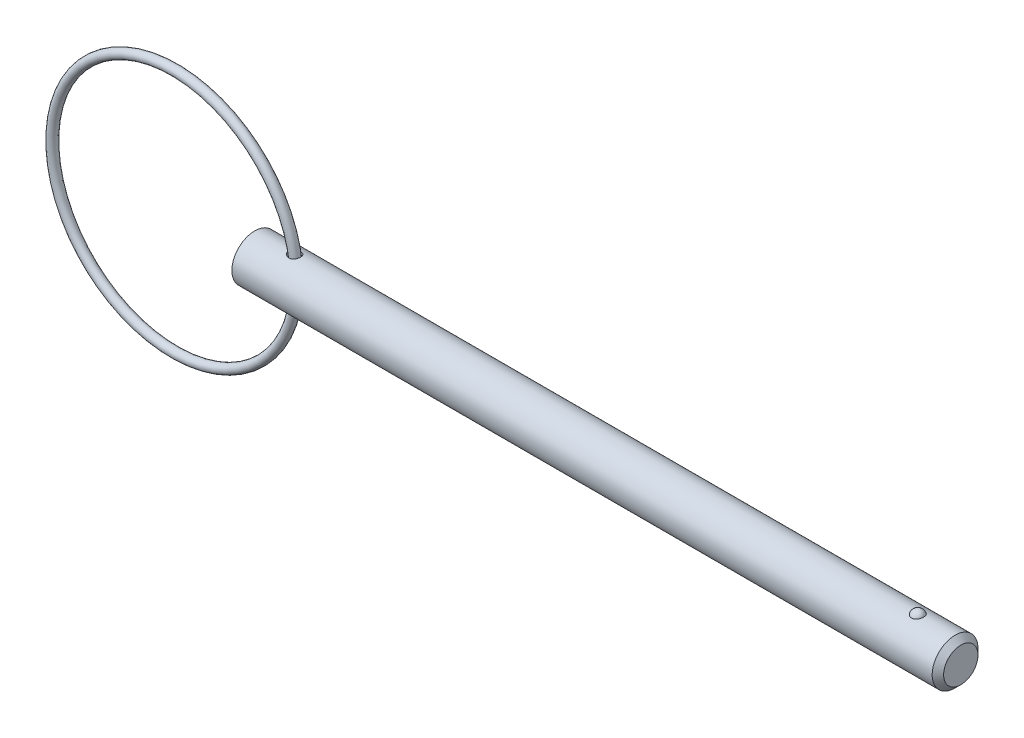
ISO-10303-21;
HEADER;
FILE_DESCRIPTION(('STEP AP214'),'2;1');
FILE_NAME('part.step','',(''),(''),'','','');
FILE_SCHEMA(('AUTOMOTIVE_DESIGN { 1 0 10303 214 1 1 1 1 }'));
ENDSEC;
DATA;
#1=APPLICATION_CONTEXT('core data for automotive mechanical design processes');
#2=APPLICATION_PROTOCOL_DEFINITION('international standard','automotive_design',2000,#1);
#3=PRODUCT_CONTEXT('',#1,'mechanical');
#4=PRODUCT('Part','Part','',(#3));
#5=PRODUCT_RELATED_PRODUCT_CATEGORY('part','',(#4));
#6=PRODUCT_DEFINITION_FORMATION('','',#4);
#7=PRODUCT_DEFINITION_CONTEXT('part definition',#1,'design');
#8=PRODUCT_DEFINITION('design','',#6,#7);
#9=PRODUCT_DEFINITION_SHAPE('','',#8);
#10=(LENGTH_UNIT() NAMED_UNIT(*) SI_UNIT(.MILLI.,.METRE.));
#11=(NAMED_UNIT(*) PLANE_ANGLE_UNIT() SI_UNIT($,.RADIAN.));
#12=(NAMED_UNIT(*) SI_UNIT($,.STERADIAN.) SOLID_ANGLE_UNIT());
#13=UNCERTAINTY_MEASURE_WITH_UNIT(LENGTH_MEASURE(1.E-05),#10,'distance_accuracy_value','');
#14=(GEOMETRIC_REPRESENTATION_CONTEXT(3) GLOBAL_UNCERTAINTY_ASSIGNED_CONTEXT((#13)) GLOBAL_UNIT_ASSIGNED_CONTEXT((#10,
#11,#12)) REPRESENTATION_CONTEXT('',''));
#15=CARTESIAN_POINT('',(0.,0.,0.));
#16=DIRECTION('',(0.,0.,1.));
#17=DIRECTION('',(1.,0.,0.));
#18=AXIS2_PLACEMENT_3D('',#15,#16,#17);
#19=CARTESIAN_POINT('',(-8.3302379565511,0.,0.));
#20=DIRECTION('',(0.,0.,1.));
#21=DIRECTION('',(1.,0.,0.));
#22=AXIS2_PLACEMENT_3D('',#19,#20,#21);
#23=TOROIDAL_SURFACE('',#22,12.7,0.476000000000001);
#24=CARTESIAN_POINT('',(4.8457620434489,0.,0.));
#25=VERTEX_POINT('',#24);
#26=VERTEX_LOOP('',#25);
#27=FACE_BOUND('',#26,.T.);
#28=ADVANCED_FACE('P0_F12',(#27),#23,.T.);
#29=CLOSED_SHELL('',(#28));
#30=MANIFOLD_SOLID_BREP('P0_B1',#29);
#31=CARTESIAN_POINT('',(0.,0.,0.));
#32=DIRECTION('',(1.,0.,0.));
#33=DIRECTION('',(0.,0.,-1.));
#34=AXIS2_PLACEMENT_3D('',#31,#32,#33);
#35=CYLINDRICAL_SURFACE('',#34,2.38);
#36=CARTESIAN_POINT('',(3.67748265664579,2.35074198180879,-0.372037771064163));
#37=CARTESIAN_POINT('',(3.70046616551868,2.34644965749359,-0.399158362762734));
#38=CARTESIAN_POINT('',(3.72581651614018,2.34199234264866,-0.424274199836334));
#39=CARTESIAN_POINT('',(3.78042747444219,2.33326580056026,-0.469907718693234));
#40=CARTESIAN_POINT('',(3.80969342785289,2.32899684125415,-0.490419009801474));
#41=CARTESIAN_POINT('',(3.87128330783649,2.32114904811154,-0.526312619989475));
#42=CARTESIAN_POINT('',(3.90360537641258,2.31756979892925,-0.541698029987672));
#43=CARTESIAN_POINT('',(3.9704452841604,2.31153734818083,-0.566889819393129));
#44=CARTESIAN_POINT('',(4.00496214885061,2.30908365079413,-0.576698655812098));
#45=CARTESIAN_POINT('',(4.07500735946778,2.30564492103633,-0.590297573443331));
#46=CARTESIAN_POINT('',(4.1105275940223,2.30465036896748,-0.594126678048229));
#47=CARTESIAN_POINT('',(4.18170718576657,2.30426876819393,-0.595606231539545));
#48=CARTESIAN_POINT('',(4.21736649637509,2.30488122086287,-0.593258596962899));
#49=CARTESIAN_POINT('',(4.28577822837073,2.30759475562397,-0.582609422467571));
#50=CARTESIAN_POINT('',(4.31858437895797,2.30961492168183,-0.574631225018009));
#51=CARTESIAN_POINT('',(4.38227060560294,2.31483318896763,-0.553233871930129));
#52=CARTESIAN_POINT('',(4.41315097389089,2.31803111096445,-0.539815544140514));
#53=CARTESIAN_POINT('',(4.47118254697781,2.3251225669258,-0.508384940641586));
#54=CARTESIAN_POINT('',(4.49841743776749,2.32899254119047,-0.490521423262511));
#55=CARTESIAN_POINT('',(4.5494826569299,2.33706025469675,-0.450515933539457));
#56=CARTESIAN_POINT('',(4.57331285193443,2.34125800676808,-0.42837379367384));
#57=CARTESIAN_POINT('',(4.6171621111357,2.34956202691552,-0.380209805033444));
#58=CARTESIAN_POINT('',(4.63714543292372,2.35366715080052,-0.354155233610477));
#59=CARTESIAN_POINT('',(4.67254725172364,2.36130301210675,-0.299034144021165));
#60=CARTESIAN_POINT('',(4.68796545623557,2.36483371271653,-0.26996743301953));
#61=CARTESIAN_POINT('',(4.71403776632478,2.37098548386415,-0.209215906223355));
#62=CARTESIAN_POINT('',(4.72462580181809,2.37359383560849,-0.177501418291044));
#63=CARTESIAN_POINT('',(4.74046966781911,2.37755210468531,-0.112692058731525));
#64=CARTESIAN_POINT('',(4.74572552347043,2.37890202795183,-0.0795971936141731));
#65=CARTESIAN_POINT('',(4.75077448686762,2.38019811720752,-0.0129544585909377));
#66=CARTESIAN_POINT('',(4.75056573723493,2.38014380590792,0.0205935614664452));
#67=CARTESIAN_POINT('',(4.74468604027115,2.37863606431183,0.0871753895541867));
#68=CARTESIAN_POINT('',(4.73901506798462,2.37718262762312,0.120209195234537));
#69=CARTESIAN_POINT('',(4.72236472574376,2.37303648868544,0.184779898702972));
#70=CARTESIAN_POINT('',(4.71139268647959,2.37034549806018,0.216318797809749));
#71=CARTESIAN_POINT('',(4.68441400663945,2.36401552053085,0.277063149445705));
#72=CARTESIAN_POINT('',(4.66840715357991,2.36037649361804,0.306268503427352));
#73=CARTESIAN_POINT('',(4.63170627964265,2.35253749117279,0.361595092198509));
#74=CARTESIAN_POINT('',(4.61100040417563,2.34833610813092,0.387708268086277));
#75=CARTESIAN_POINT('',(4.56544852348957,2.33984863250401,0.436017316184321));
#76=CARTESIAN_POINT('',(4.54060272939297,2.33556254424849,0.458213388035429));
#77=CARTESIAN_POINT('',(4.48760111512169,2.32742099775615,0.497916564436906));
#78=CARTESIAN_POINT('',(4.45946763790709,2.32356294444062,0.515452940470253));
#79=CARTESIAN_POINT('',(4.40055109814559,2.31668866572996,0.545520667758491));
#80=CARTESIAN_POINT('',(4.3697684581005,2.31367230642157,0.558052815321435));
#81=CARTESIAN_POINT('',(4.30694930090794,2.30886128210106,0.577633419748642));
#82=CARTESIAN_POINT('',(4.27493988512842,2.30704826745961,0.584764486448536));
#83=CARTESIAN_POINT('',(4.21014558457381,2.30475365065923,0.593744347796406));
#84=CARTESIAN_POINT('',(4.17736068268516,2.30427207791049,0.595593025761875));
#85=CARTESIAN_POINT('',(4.11170515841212,2.30466513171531,0.59406986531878));
#86=CARTESIAN_POINT('',(4.07883545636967,2.30554895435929,0.5906626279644));
#87=CARTESIAN_POINT('',(4.01408593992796,2.30856010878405,0.578780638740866));
#88=CARTESIAN_POINT('',(3.98220636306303,2.31068773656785,0.570304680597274));
#89=CARTESIAN_POINT('',(3.91877258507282,2.31605973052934,0.548090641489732));
#90=CARTESIAN_POINT('',(3.88730095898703,2.31935100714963,0.534128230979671));
#91=CARTESIAN_POINT('',(3.82705133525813,2.32664713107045,0.501391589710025));
#92=CARTESIAN_POINT('',(3.79827429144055,2.33065222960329,0.482615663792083));
#93=CARTESIAN_POINT('',(3.7429634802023,2.3391254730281,0.4397600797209));
#94=CARTESIAN_POINT('',(3.71658313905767,2.3436062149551,0.415484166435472));
#95=CARTESIAN_POINT('',(3.66839516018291,2.35235146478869,0.362706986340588));
#96=CARTESIAN_POINT('',(3.64658727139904,2.35661598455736,0.334205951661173));
#97=CARTESIAN_POINT('',(3.60882605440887,2.36432007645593,0.27436882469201));
#98=CARTESIAN_POINT('',(3.59274982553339,2.36777633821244,0.243112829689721));
#99=CARTESIAN_POINT('',(3.56652169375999,2.3735493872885,0.178112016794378));
#100=CARTESIAN_POINT('',(3.5563653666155,2.3758670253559,0.144369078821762));
#101=CARTESIAN_POINT('',(3.54309691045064,2.37891982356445,0.0783638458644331));
#102=CARTESIAN_POINT('',(3.53947205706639,2.37976992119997,0.0462095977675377));
#103=CARTESIAN_POINT('',(3.53785288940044,2.38014795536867,-0.0182487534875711));
#104=CARTESIAN_POINT('',(3.5398575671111,2.37967612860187,-0.0505528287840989));
#105=CARTESIAN_POINT('',(3.54913867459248,2.37752661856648,-0.112617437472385));
#106=CARTESIAN_POINT('',(3.5561353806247,2.37591295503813,-0.142422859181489));
#107=CARTESIAN_POINT('',(3.5747775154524,2.37172196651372,-0.200451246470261));
#108=CARTESIAN_POINT('',(3.58642049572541,2.36914514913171,-0.228675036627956));
#109=CARTESIAN_POINT('',(3.61071901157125,2.36396321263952,-0.276620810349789));
#110=CARTESIAN_POINT('',(3.62251818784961,2.36150235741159,-0.296799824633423));
#111=CARTESIAN_POINT('',(3.64836661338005,2.35629864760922,-0.335619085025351));
#112=CARTESIAN_POINT('',(3.66241608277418,2.353555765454,-0.354259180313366));
#113=CARTESIAN_POINT('',(3.67748265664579,2.35074198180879,-0.372037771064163));
#114=B_SPLINE_CURVE_WITH_KNOTS('',3,(#36,#37,#38,#39,#40,#41,#42,#43,#44,#45,#46,#47,#48,#49,
#50,#51,#52,#53,#54,#55,#56,#57,#58,#59,#60,#61,#62,#63,#64,#65,#66,#67,#68,#69,#70,#71,#72,#73,
#74,#75,#76,#77,#78,#79,#80,#81,#82,#83,#84,#85,#86,#87,#88,#89,#90,#91,#92,#93,#94,#95,#96,#97,
#98,#99,#100,#101,#102,#103,#104,#105,#106,#107,#108,#109,#110,#111,#112,#113),.UNSPECIFIED.,
.T.,.F.,(4,2,2,2,2,2,2,2,2,2,2,2,2,2,2,2,2,2,2,2,2,2,2,2,2,2,2,2,2,2,2,2,2,2,2,2,2,2,4),(0.,
0.107335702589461,0.214819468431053,0.322238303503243,0.429609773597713,0.536277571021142,
0.642912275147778,0.743874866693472,0.844822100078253,0.942762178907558,1.04070609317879,
1.13952022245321,1.23834068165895,1.33847507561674,1.43860899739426,1.53877695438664,
1.63894536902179,1.7389756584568,1.83901017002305,1.93929990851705,2.03958453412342,
2.13922343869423,2.23884648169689,2.33691317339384,2.43498203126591,2.53371427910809,
2.63247003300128,2.73577311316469,2.83911262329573,2.94697761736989,3.05483668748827,
3.16021984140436,3.2655241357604,3.36212700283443,3.45871257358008,3.55027266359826,
3.64178456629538,3.71214035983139,3.78250304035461),.UNSPECIFIED.);
#115=CARTESIAN_POINT('',(3.67748265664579,2.35074198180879,-0.372037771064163));
#116=VERTEX_POINT('',#115);
#117=EDGE_CURVE('P1_E40',#116,#116,#114,.T.);
#118=ORIENTED_EDGE('',*,*,#117,.T.);
#119=EDGE_LOOP('',(#118));
#120=FACE_BOUND('',#119,.T.);
#121=CARTESIAN_POINT('',(72.735,0.,0.));
#122=DIRECTION('',(1.,0.,0.));
#123=DIRECTION('',(0.,0.,-1.));
#124=AXIS2_PLACEMENT_3D('',#121,#122,#123);
#125=CIRCLE('',#124,2.38);
#126=CARTESIAN_POINT('',(72.735,0.,-2.38));
#127=VERTEX_POINT('',#126);
#128=EDGE_CURVE('P1_E25',#127,#127,#125,.T.);
#129=ORIENTED_EDGE('',*,*,#128,.F.);
#130=EDGE_LOOP('',(#129));
#131=FACE_BOUND('',#130,.T.);
#132=CARTESIAN_POINT('',(0.,0.,0.));
#133=DIRECTION('',(1.,0.,0.));
#134=DIRECTION('',(0.,0.,-1.));
#135=AXIS2_PLACEMENT_3D('',#132,#133,#134);
#136=CIRCLE('',#135,2.38);
#137=CARTESIAN_POINT('',(0.,0.,-2.38));
#138=VERTEX_POINT('',#137);
#139=EDGE_CURVE('P1_E9',#138,#138,#136,.T.);
#140=ORIENTED_EDGE('',*,*,#139,.T.);
#141=EDGE_LOOP('',(#140));
#142=FACE_BOUND('',#141,.T.);
#143=CARTESIAN_POINT('',(68.8634492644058,2.2921568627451,0.640637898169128));
#144=CARTESIAN_POINT('',(68.8303559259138,2.29215737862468,0.640637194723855));
#145=CARTESIAN_POINT('',(68.7972546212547,2.29293179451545,0.637884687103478));
#146=CARTESIAN_POINT('',(68.7320176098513,2.29594030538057,0.626968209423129));
#147=CARTESIAN_POINT('',(68.6998823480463,2.29817506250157,0.618801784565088));
#148=CARTESIAN_POINT('',(68.6375402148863,2.30384308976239,0.597351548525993));
#149=CARTESIAN_POINT('',(68.6073305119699,2.30727454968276,0.584075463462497));
#150=CARTESIAN_POINT('',(68.5495674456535,2.31495941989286,0.55282960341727));
#151=CARTESIAN_POINT('',(68.5220141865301,2.31921286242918,0.53485964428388));
#152=CARTESIAN_POINT('',(68.4695938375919,2.32820213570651,0.494282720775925));
#153=CARTESIAN_POINT('',(68.4448050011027,2.33294694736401,0.471576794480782));
#154=CARTESIAN_POINT('',(68.3992169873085,2.34234144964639,0.422446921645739));
#155=CARTESIAN_POINT('',(68.3784185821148,2.34699112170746,0.396022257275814));
#156=CARTESIAN_POINT('',(68.3403580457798,2.3559394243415,0.338855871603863));
#157=CARTESIAN_POINT('',(68.3233051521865,2.36021170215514,0.307970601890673));
#158=CARTESIAN_POINT('',(68.2943607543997,2.3677057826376,0.243750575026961));
#159=CARTESIAN_POINT('',(68.2824701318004,2.37092740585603,0.210415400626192));
#160=CARTESIAN_POINT('',(68.2638076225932,2.37606901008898,0.141189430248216));
#161=CARTESIAN_POINT('',(68.2571956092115,2.37794816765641,0.105252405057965));
#162=CARTESIAN_POINT('',(68.2498095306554,2.38005135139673,0.0327351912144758));
#163=CARTESIAN_POINT('',(68.2490358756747,2.38027526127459,-0.00384504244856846));
#164=CARTESIAN_POINT('',(68.2533628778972,2.37903842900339,-0.0769838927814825));
#165=CARTESIAN_POINT('',(68.2585202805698,2.37756141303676,-0.113538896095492));
#166=CARTESIAN_POINT('',(68.2747013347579,2.37305303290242,-0.185229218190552));
#167=CARTESIAN_POINT('',(68.2857251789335,2.37002161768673,-0.220364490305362));
#168=CARTESIAN_POINT('',(68.3133977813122,2.36273722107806,-0.288156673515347));
#169=CARTESIAN_POINT('',(68.3300389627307,2.35848588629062,-0.320816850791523));
#170=CARTESIAN_POINT('',(68.3685984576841,2.34923130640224,-0.382744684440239));
#171=CARTESIAN_POINT('',(68.390516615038,2.34422808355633,-0.412012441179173));
#172=CARTESIAN_POINT('',(68.4387549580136,2.33412555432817,-0.465830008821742));
#173=CARTESIAN_POINT('',(68.465002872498,2.32902887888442,-0.490444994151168));
#174=CARTESIAN_POINT('',(68.5214769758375,2.31926941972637,-0.5347003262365));
#175=CARTESIAN_POINT('',(68.551702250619,2.3146065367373,-0.554341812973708));
#176=CARTESIAN_POINT('',(68.6140618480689,2.30645675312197,-0.587312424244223));
#177=CARTESIAN_POINT('',(68.6460780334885,2.30293152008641,-0.600855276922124));
#178=CARTESIAN_POINT('',(68.7120795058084,2.29725171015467,-0.62222045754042));
#179=CARTESIAN_POINT('',(68.7460641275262,2.29509667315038,-0.63004470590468));
#180=CARTESIAN_POINT('',(68.813299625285,2.29249264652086,-0.639452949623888));
#181=CARTESIAN_POINT('',(68.8465087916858,2.29196755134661,-0.641315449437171));
#182=CARTESIAN_POINT('',(68.912763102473,2.29246849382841,-0.639522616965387));
#183=CARTESIAN_POINT('',(68.9458082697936,2.29349430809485,-0.635868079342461));
#184=CARTESIAN_POINT('',(69.0101025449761,2.29694059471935,-0.623301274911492));
#185=CARTESIAN_POINT('',(69.0413744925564,2.29933234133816,-0.614497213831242));
#186=CARTESIAN_POINT('',(69.1019952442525,2.30522511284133,-0.592006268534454));
#187=CARTESIAN_POINT('',(69.1313438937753,2.30872622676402,-0.578318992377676));
#188=CARTESIAN_POINT('',(69.1880369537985,2.31655795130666,-0.546112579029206));
#189=CARTESIAN_POINT('',(69.215320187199,2.32090569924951,-0.527490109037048));
#190=CARTESIAN_POINT('',(69.2664904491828,2.32992206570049,-0.48611785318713));
#191=CARTESIAN_POINT('',(69.2903767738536,2.33459075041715,-0.463367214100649));
#192=CARTESIAN_POINT('',(69.3352722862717,2.34399834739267,-0.413220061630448));
#193=CARTESIAN_POINT('',(69.3560972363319,2.34873051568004,-0.385657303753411));
#194=CARTESIAN_POINT('',(69.393056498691,2.35754932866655,-0.327455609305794));
#195=CARTESIAN_POINT('',(69.4091898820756,2.36163584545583,-0.296816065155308));
#196=CARTESIAN_POINT('',(69.4369822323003,2.36889321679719,-0.232047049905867));
#197=CARTESIAN_POINT('',(69.4484450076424,2.37202275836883,-0.197828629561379));
#198=CARTESIAN_POINT('',(69.4657523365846,2.37681926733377,-0.127900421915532));
#199=CARTESIAN_POINT('',(69.4715962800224,2.37848607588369,-0.0921904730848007));
#200=CARTESIAN_POINT('',(69.477605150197,2.38020024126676,-0.0196348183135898));
#201=CARTESIAN_POINT('',(69.4776704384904,2.38021918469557,0.0172198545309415));
#202=CARTESIAN_POINT('',(69.4718689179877,2.37856356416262,0.0904219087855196));
#203=CARTESIAN_POINT('',(69.4660018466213,2.37688892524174,0.126769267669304));
#204=CARTESIAN_POINT('',(69.448425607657,2.37201688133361,0.198028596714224));
#205=CARTESIAN_POINT('',(69.436699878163,2.36881516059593,0.232936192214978));
#206=CARTESIAN_POINT('',(69.4076354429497,2.36123444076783,0.300196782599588));
#207=CARTESIAN_POINT('',(69.3902967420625,2.3568554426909,0.332549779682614));
#208=CARTESIAN_POINT('',(69.3505350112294,2.34744667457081,0.393495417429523));
#209=CARTESIAN_POINT('',(69.3281528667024,2.34242227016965,0.422115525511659));
#210=CARTESIAN_POINT('',(69.2787391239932,2.33227293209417,0.475004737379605));
#211=CARTESIAN_POINT('',(69.2517076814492,2.32714800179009,0.499273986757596));
#212=CARTESIAN_POINT('',(69.1944988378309,2.31755359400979,0.54204602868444));
#213=CARTESIAN_POINT('',(69.1644297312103,2.31306986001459,0.560690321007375));
#214=CARTESIAN_POINT('',(69.1013869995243,2.3051412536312,0.592447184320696));
#215=CARTESIAN_POINT('',(69.0684158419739,2.30169550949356,0.605564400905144));
#216=CARTESIAN_POINT('',(69.0068424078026,2.29677744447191,0.623927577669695));
#217=CARTESIAN_POINT('',(68.9785555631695,2.29505839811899,0.63017893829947));
#218=CARTESIAN_POINT('',(68.9213308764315,2.29274795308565,0.638534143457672));
#219=CARTESIAN_POINT('',(68.8923931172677,2.29215641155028,0.64063851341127));
#220=CARTESIAN_POINT('',(68.8634492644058,2.2921568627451,0.640637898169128));
#221=B_SPLINE_CURVE_WITH_KNOTS('',3,(#143,#144,#145,#146,#147,#148,#149,#150,#151,#152,#153,
#154,#155,#156,#157,#158,#159,#160,#161,#162,#163,#164,#165,#166,#167,#168,#169,#170,#171,#172,
#173,#174,#175,#176,#177,#178,#179,#180,#181,#182,#183,#184,#185,#186,#187,#188,#189,#190,#191,
#192,#193,#194,#195,#196,#197,#198,#199,#200,#201,#202,#203,#204,#205,#206,#207,#208,#209,#210,
#211,#212,#213,#214,#215,#216,#217,#218,#219,#220),.UNSPECIFIED.,.T.,.F.,(4,2,2,2,2,2,2,2,2,2,2,
2,2,2,2,2,2,2,2,2,2,2,2,2,2,2,2,2,2,2,2,2,2,2,2,2,2,2,4),(0.,0.0991724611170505,
0.198389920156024,0.297457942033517,0.396529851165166,0.497927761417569,0.599345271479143,
0.705475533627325,0.811623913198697,0.920876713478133,1.03013718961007,1.1404517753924,
1.25076998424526,1.3609399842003,1.47110672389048,1.57959248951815,1.6880533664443,
1.79234266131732,1.89659691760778,1.99590391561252,2.0951966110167,2.19247425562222,
2.28975970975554,2.38926978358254,2.48880044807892,2.59293588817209,2.69709193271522,
2.80525821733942,2.91343624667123,3.02347917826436,3.13352698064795,3.24388765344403,
3.35424823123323,3.46374443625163,3.57323697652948,3.67968690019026,3.78604717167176,
3.87279565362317,3.9595331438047),.UNSPECIFIED.);
#222=CARTESIAN_POINT('',(68.8634492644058,2.2921568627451,0.640637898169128));
#223=VERTEX_POINT('',#222);
#224=EDGE_CURVE('P1_E34',#223,#223,#221,.T.);
#225=ORIENTED_EDGE('',*,*,#224,.T.);
#226=EDGE_LOOP('',(#225));
#227=FACE_BOUND('',#226,.T.);
#228=CARTESIAN_POINT('',(3.67748265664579,-2.35074198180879,-0.372037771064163));
#229=CARTESIAN_POINT('',(3.65652023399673,-2.35465684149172,-0.34730037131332));
#230=CARTESIAN_POINT('',(3.63751328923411,-2.35843676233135,-0.320880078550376));
#231=CARTESIAN_POINT('',(3.60404107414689,-2.36534227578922,-0.265218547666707));
#232=CARTESIAN_POINT('',(3.58957485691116,-2.36846800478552,-0.235977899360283));
#233=CARTESIAN_POINT('',(3.56572865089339,-2.37373250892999,-0.17528149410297));
#234=CARTESIAN_POINT('',(3.55636565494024,-2.37586798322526,-0.143818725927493));
#235=CARTESIAN_POINT('',(3.54325775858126,-2.37888184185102,-0.0796854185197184));
#236=CARTESIAN_POINT('',(3.53951093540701,-2.37976065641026,-0.047015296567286));
#237=CARTESIAN_POINT('',(3.53787230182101,-2.38014359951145,0.0167788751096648));
#238=CARTESIAN_POINT('',(3.53968714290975,-2.37971660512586,0.0478953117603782));
#239=CARTESIAN_POINT('',(3.54844977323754,-2.37768530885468,0.10935299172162));
#240=CARTESIAN_POINT('',(3.55539746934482,-2.37608102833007,0.139694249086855));
#241=CARTESIAN_POINT('',(3.57400783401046,-2.37189301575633,0.198451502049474));
#242=CARTESIAN_POINT('',(3.58561918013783,-2.36931996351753,0.226884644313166));
#243=CARTESIAN_POINT('',(3.61310377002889,-2.36345094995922,0.281524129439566));
#244=CARTESIAN_POINT('',(3.62897804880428,-2.36015481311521,0.307729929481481));
#245=CARTESIAN_POINT('',(3.66562367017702,-2.35291979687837,0.359001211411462));
#246=CARTESIAN_POINT('',(3.68664499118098,-2.34895316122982,0.38388386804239));
#247=CARTESIAN_POINT('',(3.73230875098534,-2.34094029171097,0.430056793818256));
#248=CARTESIAN_POINT('',(3.75695270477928,-2.33689402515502,0.451345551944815));
#249=CARTESIAN_POINT('',(3.81128123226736,-2.32880869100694,0.491427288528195));
#250=CARTESIAN_POINT('',(3.84120889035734,-2.32479472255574,0.509896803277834));
#251=CARTESIAN_POINT('',(3.90376464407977,-2.31758417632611,0.541729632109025));
#252=CARTESIAN_POINT('',(3.93639323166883,-2.31438774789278,0.555092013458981));
#253=CARTESIAN_POINT('',(4.00416670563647,-2.30915137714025,0.576493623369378));
#254=CARTESIAN_POINT('',(4.0393485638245,-2.30713552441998,0.584422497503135));
#255=CARTESIAN_POINT('',(4.11060438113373,-2.30465258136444,0.594140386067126));
#256=CARTESIAN_POINT('',(4.14667802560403,-2.30418495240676,0.595931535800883));
#257=CARTESIAN_POINT('',(4.21693481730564,-2.30488473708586,0.593218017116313));
#258=CARTESIAN_POINT('',(4.25112951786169,-2.30597897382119,0.588995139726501));
#259=CARTESIAN_POINT('',(4.31821509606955,-2.30956729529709,0.57476284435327));
#260=CARTESIAN_POINT('',(4.35110629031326,-2.31206103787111,0.564754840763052));
#261=CARTESIAN_POINT('',(4.41316900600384,-2.31802118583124,0.53975368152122));
#262=CARTESIAN_POINT('',(4.44243993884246,-2.32144077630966,0.524995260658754));
#263=CARTESIAN_POINT('',(4.49802365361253,-2.32890801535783,0.49080792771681));
#264=CARTESIAN_POINT('',(4.52433643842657,-2.33295566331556,0.471379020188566));
#265=CARTESIAN_POINT('',(4.57327790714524,-2.3412242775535,0.428422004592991));
#266=CARTESIAN_POINT('',(4.59591094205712,-2.34544503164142,0.404898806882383));
#267=CARTESIAN_POINT('',(4.63697038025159,-2.35360640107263,0.354387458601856));
#268=CARTESIAN_POINT('',(4.65539647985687,-2.35754699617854,0.327399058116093));
#269=CARTESIAN_POINT('',(4.68784943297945,-2.36478461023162,0.270249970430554));
#270=CARTESIAN_POINT('',(4.70180333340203,-2.36807065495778,0.240046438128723));
#271=CARTESIAN_POINT('',(4.72457181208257,-2.3735656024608,0.177668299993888));
#272=CARTESIAN_POINT('',(4.73338630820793,-2.37577448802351,0.145493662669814));
#273=CARTESIAN_POINT('',(4.74568442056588,-2.37888446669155,0.0799353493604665));
#274=CARTESIAN_POINT('',(4.74914498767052,-2.37977990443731,0.0465470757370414));
#275=CARTESIAN_POINT('',(4.7505750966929,-2.38014803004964,-0.0203543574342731));
#276=CARTESIAN_POINT('',(4.74854468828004,-2.37962073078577,-0.0538675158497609));
#277=CARTESIAN_POINT('',(4.73905606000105,-2.37720346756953,-0.119981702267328));
#278=CARTESIAN_POINT('',(4.73161109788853,-2.37531683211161,-0.152584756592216));
#279=CARTESIAN_POINT('',(4.71149336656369,-2.37038779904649,-0.21604453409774));
#280=CARTESIAN_POINT('',(4.69882040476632,-2.36734535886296,-0.246901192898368));
#281=CARTESIAN_POINT('',(4.66852750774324,-2.3604270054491,-0.306062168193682));
#282=CARTESIAN_POINT('',(4.6508974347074,-2.35654938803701,-0.334361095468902));
#283=CARTESIAN_POINT('',(4.61113860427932,-2.34839114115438,-0.387535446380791));
#284=CARTESIAN_POINT('',(4.5890098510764,-2.34411051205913,-0.412410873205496));
#285=CARTESIAN_POINT('',(4.54086484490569,-2.33563475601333,-0.457982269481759));
#286=CARTESIAN_POINT('',(4.51485596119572,-2.33143948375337,-0.478685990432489));
#287=CARTESIAN_POINT('',(4.45962330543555,-2.32360655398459,-0.515369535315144));
#288=CARTESIAN_POINT('',(4.43040000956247,-2.31996881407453,-0.53135005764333));
#289=CARTESIAN_POINT('',(4.37002624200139,-2.31371771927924,-0.557938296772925));
#290=CARTESIAN_POINT('',(4.33891082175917,-2.31108995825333,-0.56862225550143));
#291=CARTESIAN_POINT('',(4.27527207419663,-2.30707117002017,-0.584715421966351));
#292=CARTESIAN_POINT('',(4.24274884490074,-2.30568005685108,-0.590124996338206));
#293=CARTESIAN_POINT('',(4.17738918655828,-2.30427145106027,-0.595601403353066));
#294=CARTESIAN_POINT('',(4.14455499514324,-2.3042474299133,-0.595693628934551));
#295=CARTESIAN_POINT('',(4.07930726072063,-2.30552664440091,-0.590722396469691));
#296=CARTESIAN_POINT('',(4.04689380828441,-2.3068301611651,-0.585657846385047));
#297=CARTESIAN_POINT('',(3.98220150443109,-2.31066076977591,-0.570360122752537));
#298=CARTESIAN_POINT('',(3.94996602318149,-2.31322859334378,-0.559954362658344));
#299=CARTESIAN_POINT('',(3.88760707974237,-2.31930140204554,-0.534242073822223));
#300=CARTESIAN_POINT('',(3.85748403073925,-2.32280656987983,-0.518934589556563));
#301=CARTESIAN_POINT('',(3.80033132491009,-2.33034138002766,-0.483968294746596));
#302=CARTESIAN_POINT('',(3.77327623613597,-2.33436601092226,-0.464349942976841));
#303=CARTESIAN_POINT('',(3.72262060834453,-2.34255524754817,-0.421092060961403));
#304=CARTESIAN_POINT('',(3.69901956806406,-2.34671983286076,-0.397453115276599));
#305=CARTESIAN_POINT('',(3.67748265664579,-2.35074198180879,-0.372037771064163));
#306=B_SPLINE_CURVE_WITH_KNOTS('',3,(#228,#229,#230,#231,#232,#233,#234,#235,#236,#237,#238,
#239,#240,#241,#242,#243,#244,#245,#246,#247,#248,#249,#250,#251,#252,#253,#254,#255,#256,#257,
#258,#259,#260,#261,#262,#263,#264,#265,#266,#267,#268,#269,#270,#271,#272,#273,#274,#275,#276,
#277,#278,#279,#280,#281,#282,#283,#284,#285,#286,#287,#288,#289,#290,#291,#292,#293,#294,#295,
#296,#297,#298,#299,#300,#301,#302,#303,#304,#305),.UNSPECIFIED.,.T.,.F.,(4,2,2,2,2,2,2,2,2,2,2,
2,2,2,2,2,2,2,2,2,2,2,2,2,2,2,2,2,2,2,2,2,2,2,2,2,2,2,4),(0.,0.09787553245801,0.19573064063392,
0.293909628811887,0.39205499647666,0.485114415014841,0.578172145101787,0.670232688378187,
0.762315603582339,0.860342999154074,0.958411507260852,1.06411708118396,1.16984195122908,
1.27765506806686,1.38543067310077,1.48831936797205,1.59118291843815,1.68959047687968,
1.78799793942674,1.88628818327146,1.98458551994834,2.08441314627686,2.18424236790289,
2.28450017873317,2.3847570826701,2.4847693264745,2.58478525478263,2.68500723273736,
2.78522911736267,2.8852630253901,2.98528213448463,3.08381637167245,3.18234375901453,
3.28040059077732,3.37847819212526,3.47994551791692,3.58143263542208,3.68200512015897,
3.78256299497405),.UNSPECIFIED.);
#307=CARTESIAN_POINT('',(3.67748265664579,-2.35074198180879,-0.372037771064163));
#308=VERTEX_POINT('',#307);
#309=EDGE_CURVE('P1_E17',#308,#308,#306,.T.);
#310=ORIENTED_EDGE('',*,*,#309,.T.);
#311=EDGE_LOOP('',(#310));
#312=FACE_BOUND('',#311,.T.);
#313=ADVANCED_FACE('P1_F13',(#120,#131,#142,#227,#312),#35,.T.);
#314=CARTESIAN_POINT('',(0.,0.,0.));
#315=DIRECTION('',(-1.,0.,0.));
#316=DIRECTION('',(0.,0.,1.));
#317=AXIS2_PLACEMENT_3D('',#314,#315,#316);
#318=PLANE('',#317);
#319=ORIENTED_EDGE('',*,*,#139,.F.);
#320=EDGE_LOOP('',(#319));
#321=FACE_BOUND('',#320,.T.);
#322=ADVANCED_FACE('P1_F15',(#321),#318,.T.);
#323=CARTESIAN_POINT('',(73.33,0.,0.));
#324=DIRECTION('',(-1.,0.,0.));
#325=DIRECTION('',(0.,0.,1.));
#326=AXIS2_PLACEMENT_3D('',#323,#324,#325);
#327=CONICAL_SURFACE('',#326,1.78500000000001,0.785398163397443);
#328=ORIENTED_EDGE('',*,*,#128,.T.);
#329=EDGE_LOOP('',(#328));
#330=FACE_BOUND('',#329,.T.);
#331=CARTESIAN_POINT('',(73.33,0.,0.));
#332=DIRECTION('',(1.,0.,0.));
#333=DIRECTION('',(0.,0.,-1.));
#334=AXIS2_PLACEMENT_3D('',#331,#332,#333);
#335=CIRCLE('',#334,1.78500000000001);
#336=CARTESIAN_POINT('',(73.33,0.,-1.78500000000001));
#337=VERTEX_POINT('',#336);
#338=EDGE_CURVE('P1_E30',#337,#337,#335,.T.);
#339=ORIENTED_EDGE('',*,*,#338,.F.);
#340=EDGE_LOOP('',(#339));
#341=FACE_BOUND('',#340,.T.);
#342=ADVANCED_FACE('P1_F55',(#330,#341),#327,.T.);
#343=CARTESIAN_POINT('',(73.33,1.78500000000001,0.));
#344=DIRECTION('',(1.,0.,0.));
#345=DIRECTION('',(0.,0.,-1.));
#346=AXIS2_PLACEMENT_3D('',#343,#344,#345);
#347=PLANE('',#346);
#348=ORIENTED_EDGE('',*,*,#338,.T.);
#349=EDGE_LOOP('',(#348));
#350=FACE_BOUND('',#349,.T.);
#351=ADVANCED_FACE('P1_F51',(#350),#347,.T.);
#352=CARTESIAN_POINT('',(68.8634492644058,2.142,0.));
#353=DIRECTION('',(-1.,0.,0.));
#354=DIRECTION('',(0.,1.,0.));
#355=AXIS2_PLACEMENT_3D('',#352,#353,#354);
#356=SPHERICAL_SURFACE('',#355,0.658000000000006);
#357=ORIENTED_EDGE('',*,*,#224,.F.);
#358=EDGE_LOOP('',(#357));
#359=FACE_BOUND('',#358,.T.);
#360=ADVANCED_FACE('P1_F46',(#359),#356,.T.);
#361=CARTESIAN_POINT('',(-8.33023795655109,0.,0.));
#362=DIRECTION('',(0.,0.,1.));
#363=DIRECTION('',(1.,0.,0.));
#364=AXIS2_PLACEMENT_3D('',#361,#362,#363);
#365=TOROIDAL_SURFACE('',#364,12.7,0.594999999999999);
#366=ORIENTED_EDGE('',*,*,#309,.F.);
#367=EDGE_LOOP('',(#366));
#368=FACE_BOUND('',#367,.T.);
#369=ORIENTED_EDGE('',*,*,#117,.F.);
#370=EDGE_LOOP('',(#369));
#371=FACE_BOUND('',#370,.T.);
#372=ADVANCED_FACE('P1_F50',(#368,#371),#365,.F.);
#373=CLOSED_SHELL('',(#313,#322,#342,#351,#360,#372));
#374=MANIFOLD_SOLID_BREP('P1_B1',#373);
#375=ADVANCED_BREP_SHAPE_REPRESENTATION('',(#18,#30,#374),#14);
#376=SHAPE_DEFINITION_REPRESENTATION(#9,#375);
ENDSEC;
END-ISO-10303-21;
